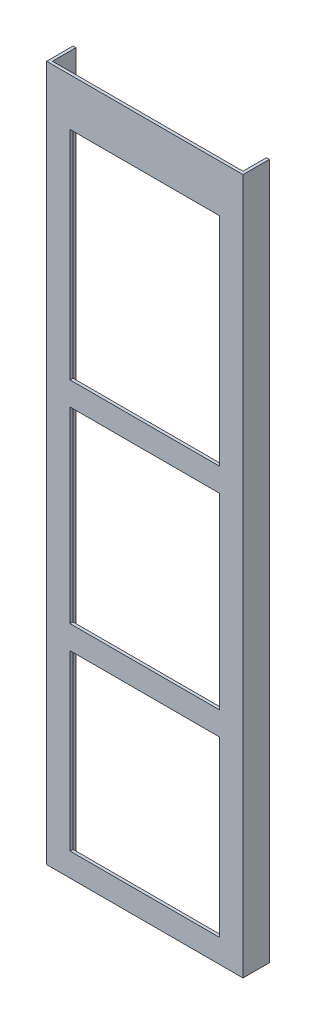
from build123d import *

# Parameters (mm, degrees)
SKETCH1_W              = 103.175
SKETCH1_H              = 103.175
SKETCH1_W_2            = 100
SKETCH1_H_2            = 100
BULKSHELLEXTRUDE_DEPTH = 376.8
SKETCH14_W             = 77.775
SKETCH14_H             = 351.4
SIDEWALLCUT_DEPTH      = 103.1875
SKETCH22_W             = 100
SKETCH22_H             = 376.8
CUT_EXTRUDE4_DEPTH     = 103.1875
SKETCH23_W             = 1.5875
SKETCH23_H             = 376.8
BOSS_EXTRUDE1_DEPTH    = 1.5875
SKETCH24_W             = 1.5875
SKETCH24_H             = 376.8
BOSS_EXTRUDE2_DEPTH    = 12.7
SKETCH25_W             = 80.95
SKETCH25_H             = 351.4
CUT_EXTRUDE5_DEPTH     = 2.54
SKETCH26_W             = 80.95
SKETCH26_H             = 12.945
SKETCH26_H_2           = 12.7
BOSS_EXTRUDE3_DEPTH    = 1.5875


with BuildPart() as part:
    # Sketch1 → BulkShellExtrude (new body)
    with BuildSketch(Plane(origin=(0, 0, 0), x_dir=(1, 0, 0), z_dir=(0, 1, 0))):
        Rectangle(SKETCH1_W, SKETCH1_H)
        Rectangle(SKETCH1_W_2, SKETCH1_H_2, mode=Mode.SUBTRACT)
    extrude(amount=BULKSHELLEXTRUDE_DEPTH)

    # Sketch14 → SideWallCut (cut)
    with BuildSketch(Plane(origin=(51.5875, 0, 0), x_dir=(0, 0, -1), z_dir=(1, 0, 0))):
        with Locations((0, 188.4)):
            Rectangle(SKETCH14_W, SKETCH14_H)
    extrude(amount=-SIDEWALLCUT_DEPTH, mode=Mode.SUBTRACT)

    # Sketch22 → Cut-Extrude4 (cut)
    with BuildSketch(Plane(origin=(51.5875, 0, 0), x_dir=(0, 0, -1), z_dir=(1, 0, 0))):
        with Locations((0, 188.4)):
            Rectangle(SKETCH22_W, SKETCH22_H)
    extrude(amount=-CUT_EXTRUDE4_DEPTH, mode=Mode.SUBTRACT)


with BuildPart() as body_2:
    # of the pieces the cut leaves, the one that is kept (cut_extrude4_keep)
    add(part.part.solids().sort_by_distance((51.5875, 0, 51.5875))[0])

    # Sketch23 → Boss-Extrude1 (add)
    with BuildSketch(Plane(origin=(51.5875, 0, 0), x_dir=(0, 0, -1), z_dir=(1, 0, 0))):
        with Locations((-50.79375, 188.4)):
            Rectangle(SKETCH23_W, SKETCH23_H)
    boss_extrude1 = extrude(amount=BOSS_EXTRUDE1_DEPTH)

    # Mirror1: Boss-Extrude1 across plane
    add(boss_extrude1.mirror(Plane(origin=(0, 0, 0), x_dir=(0, 0, 1), z_dir=(1, 0, 0))))

    # Sketch24 → Boss-Extrude2 (add)
    with BuildSketch(Plane(origin=(0, 0, 50), x_dir=(-1, 0, 0), z_dir=(0, 0, -1))):
        with Locations((-52.38125, 188.4)):
            Rectangle(SKETCH24_W, SKETCH24_H)
        with Locations((52.38125, 188.4)):
            Rectangle(SKETCH24_W, SKETCH24_H)
    extrude(amount=BOSS_EXTRUDE2_DEPTH)

    # Sketch25 → Cut-Extrude5 (cut)
    with BuildSketch(Plane.XY.offset(51.5875)):
        with Locations((0, 188.4)):
            Rectangle(SKETCH25_W, SKETCH25_H)
    extrude(amount=-CUT_EXTRUDE5_DEPTH, mode=Mode.SUBTRACT)

    # Sketch26 → Boss-Extrude3 (add)
    with BuildSketch(Plane.XY.offset(51.5875)):
        with Locations((0, 357.6275)):
            Rectangle(SKETCH26_W, SKETCH26_H)
        with Locations((0, 227.33)):
            Rectangle(SKETCH26_W, SKETCH26_H_2)
        with Locations((0, 113.03)):
            Rectangle(SKETCH26_W, SKETCH26_H_2)
    extrude(amount=-BOSS_EXTRUDE3_DEPTH)


solid = body_2.part
